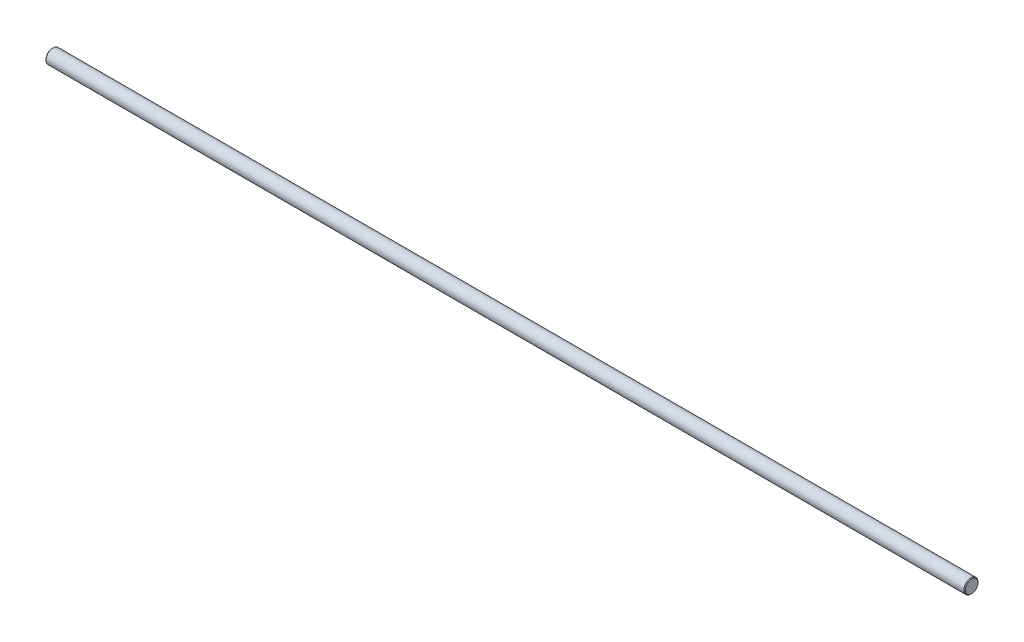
ISO-10303-21;
HEADER;
FILE_DESCRIPTION(('STEP AP214'),'2;1');
FILE_NAME('part.step','',(''),(''),'','','');
FILE_SCHEMA(('AUTOMOTIVE_DESIGN { 1 0 10303 214 1 1 1 1 }'));
ENDSEC;
DATA;
#1=APPLICATION_CONTEXT('core data for automotive mechanical design processes');
#2=APPLICATION_PROTOCOL_DEFINITION('international standard','automotive_design',2000,#1);
#3=PRODUCT_CONTEXT('',#1,'mechanical');
#4=PRODUCT('Part','Part','',(#3));
#5=PRODUCT_RELATED_PRODUCT_CATEGORY('part','',(#4));
#6=PRODUCT_DEFINITION_FORMATION('','',#4);
#7=PRODUCT_DEFINITION_CONTEXT('part definition',#1,'design');
#8=PRODUCT_DEFINITION('design','',#6,#7);
#9=PRODUCT_DEFINITION_SHAPE('','',#8);
#10=(LENGTH_UNIT() NAMED_UNIT(*) SI_UNIT(.MILLI.,.METRE.));
#11=(NAMED_UNIT(*) PLANE_ANGLE_UNIT() SI_UNIT($,.RADIAN.));
#12=(NAMED_UNIT(*) SI_UNIT($,.STERADIAN.) SOLID_ANGLE_UNIT());
#13=UNCERTAINTY_MEASURE_WITH_UNIT(LENGTH_MEASURE(1.E-05),#10,'distance_accuracy_value','');
#14=(GEOMETRIC_REPRESENTATION_CONTEXT(3) GLOBAL_UNCERTAINTY_ASSIGNED_CONTEXT((#13)) GLOBAL_UNIT_ASSIGNED_CONTEXT((#10,
#11,#12)) REPRESENTATION_CONTEXT('',''));
#15=CARTESIAN_POINT('',(0.,0.,0.));
#16=DIRECTION('',(0.,0.,1.));
#17=DIRECTION('',(1.,0.,0.));
#18=AXIS2_PLACEMENT_3D('',#15,#16,#17);
#19=CARTESIAN_POINT('',(650.,0.,0.));
#20=DIRECTION('',(1.,0.,0.));
#21=DIRECTION('',(0.,0.,-1.));
#22=AXIS2_PLACEMENT_3D('',#19,#20,#21);
#23=PLANE('',#22);
#24=CARTESIAN_POINT('',(649.999999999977,0.,0.));
#25=DIRECTION('',(-1.,0.,0.));
#26=DIRECTION('',(0.,0.,1.));
#27=AXIS2_PLACEMENT_3D('',#24,#25,#26);
#28=CIRCLE('',#27,4.50000000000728);
#29=CARTESIAN_POINT('',(649.999999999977,0.,4.50000000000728));
#30=VERTEX_POINT('',#29);
#31=EDGE_CURVE('E18',#30,#30,#28,.T.);
#32=ORIENTED_EDGE('',*,*,#31,.F.);
#33=EDGE_LOOP('',(#32));
#34=FACE_BOUND('',#33,.T.);
#35=ADVANCED_FACE('F15',(#34),#23,.T.);
#36=CARTESIAN_POINT('',(0.,0.,0.));
#37=DIRECTION('',(1.,0.,0.));
#38=DIRECTION('',(0.,0.,-1.));
#39=AXIS2_PLACEMENT_3D('',#36,#37,#38);
#40=PLANE('',#39);
#41=CARTESIAN_POINT('',(0.,0.,0.));
#42=DIRECTION('',(1.,0.,0.));
#43=DIRECTION('',(0.,0.,-1.));
#44=AXIS2_PLACEMENT_3D('',#41,#42,#43);
#45=CIRCLE('',#44,4.50000000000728);
#46=CARTESIAN_POINT('',(0.,0.,-4.50000000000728));
#47=VERTEX_POINT('',#46);
#48=EDGE_CURVE('E27',#47,#47,#45,.T.);
#49=ORIENTED_EDGE('',*,*,#48,.F.);
#50=EDGE_LOOP('',(#49));
#51=FACE_BOUND('',#50,.T.);
#52=ADVANCED_FACE('F38',(#51),#40,.F.);
#53=CARTESIAN_POINT('',(649.500000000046,0.,0.));
#54=DIRECTION('',(-1.,0.,0.));
#55=DIRECTION('',(0.,0.,1.));
#56=AXIS2_PLACEMENT_3D('',#53,#54,#55);
#57=CONICAL_SURFACE('',#56,4.99999999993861,0.785398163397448);
#58=CARTESIAN_POINT('',(649.5,0.,0.));
#59=DIRECTION('',(-1.,0.,0.));
#60=DIRECTION('',(0.,0.,1.));
#61=AXIS2_PLACEMENT_3D('',#58,#59,#60);
#62=CIRCLE('',#61,5.);
#63=CARTESIAN_POINT('',(649.5,0.,5.));
#64=VERTEX_POINT('',#63);
#65=EDGE_CURVE('E22',#64,#64,#62,.T.);
#66=ORIENTED_EDGE('',*,*,#65,.F.);
#67=EDGE_LOOP('',(#66));
#68=FACE_BOUND('',#67,.T.);
#69=ORIENTED_EDGE('',*,*,#31,.T.);
#70=EDGE_LOOP('',(#69));
#71=FACE_BOUND('',#70,.T.);
#72=ADVANCED_FACE('F35',(#68,#71),#57,.T.);
#73=CARTESIAN_POINT('',(0.50000000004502,0.,0.));
#74=DIRECTION('',(1.,0.,0.));
#75=DIRECTION('',(0.,0.,-1.));
#76=AXIS2_PLACEMENT_3D('',#73,#74,#75);
#77=CONICAL_SURFACE('',#76,4.99999999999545,0.785398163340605);
#78=CARTESIAN_POINT('',(0.499999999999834,0.,0.));
#79=DIRECTION('',(-1.,0.,0.));
#80=DIRECTION('',(0.,0.,1.));
#81=AXIS2_PLACEMENT_3D('',#78,#79,#80);
#82=CIRCLE('',#81,5.);
#83=CARTESIAN_POINT('',(0.499999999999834,0.,5.));
#84=VERTEX_POINT('',#83);
#85=EDGE_CURVE('E10',#84,#84,#82,.F.);
#86=ORIENTED_EDGE('',*,*,#85,.F.);
#87=EDGE_LOOP('',(#86));
#88=FACE_BOUND('',#87,.T.);
#89=ORIENTED_EDGE('',*,*,#48,.T.);
#90=EDGE_LOOP('',(#89));
#91=FACE_BOUND('',#90,.T.);
#92=ADVANCED_FACE('F46',(#88,#91),#77,.T.);
#93=CARTESIAN_POINT('',(650.,0.,0.));
#94=DIRECTION('',(-1.,0.,0.));
#95=DIRECTION('',(0.,0.,1.));
#96=AXIS2_PLACEMENT_3D('',#93,#94,#95);
#97=CYLINDRICAL_SURFACE('',#96,5.);
#98=ORIENTED_EDGE('',*,*,#85,.T.);
#99=EDGE_LOOP('',(#98));
#100=FACE_BOUND('',#99,.T.);
#101=ORIENTED_EDGE('',*,*,#65,.T.);
#102=EDGE_LOOP('',(#101));
#103=FACE_BOUND('',#102,.T.);
#104=ADVANCED_FACE('F44',(#100,#103),#97,.T.);
#105=CLOSED_SHELL('',(#35,#52,#72,#92,#104));
#106=MANIFOLD_SOLID_BREP('B1',#105);
#107=ADVANCED_BREP_SHAPE_REPRESENTATION('',(#18,#106),#14);
#108=SHAPE_DEFINITION_REPRESENTATION(#9,#107);
ENDSEC;
END-ISO-10303-21;
